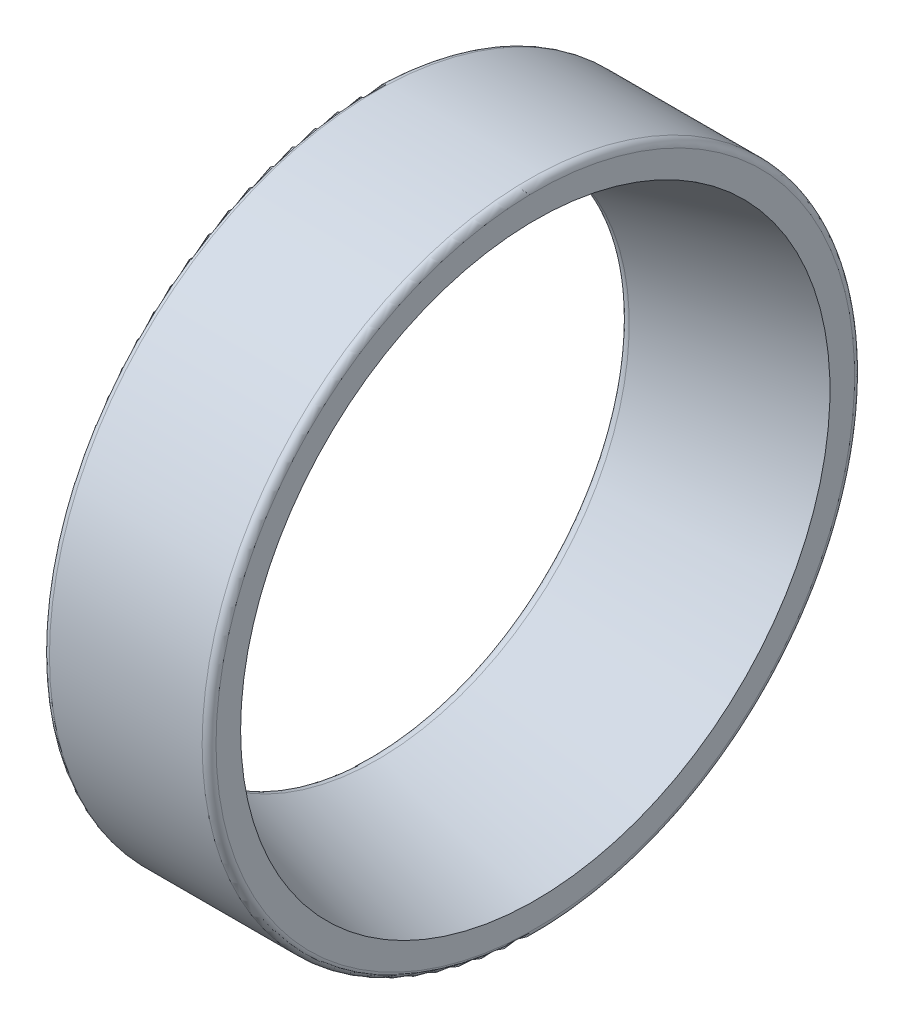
ISO-10303-21;
HEADER;
FILE_DESCRIPTION(('STEP AP214'),'2;1');
FILE_NAME('part.step','',(''),(''),'','','');
FILE_SCHEMA(('AUTOMOTIVE_DESIGN { 1 0 10303 214 1 1 1 1 }'));
ENDSEC;
DATA;
#1=APPLICATION_CONTEXT('core data for automotive mechanical design processes');
#2=APPLICATION_PROTOCOL_DEFINITION('international standard','automotive_design',2000,#1);
#3=PRODUCT_CONTEXT('',#1,'mechanical');
#4=PRODUCT('Part','Part','',(#3));
#5=PRODUCT_RELATED_PRODUCT_CATEGORY('part','',(#4));
#6=PRODUCT_DEFINITION_FORMATION('','',#4);
#7=PRODUCT_DEFINITION_CONTEXT('part definition',#1,'design');
#8=PRODUCT_DEFINITION('design','',#6,#7);
#9=PRODUCT_DEFINITION_SHAPE('','',#8);
#10=(LENGTH_UNIT() NAMED_UNIT(*) SI_UNIT(.MILLI.,.METRE.));
#11=(NAMED_UNIT(*) PLANE_ANGLE_UNIT() SI_UNIT($,.RADIAN.));
#12=(NAMED_UNIT(*) SI_UNIT($,.STERADIAN.) SOLID_ANGLE_UNIT());
#13=UNCERTAINTY_MEASURE_WITH_UNIT(LENGTH_MEASURE(1.E-05),#10,'distance_accuracy_value','');
#14=(GEOMETRIC_REPRESENTATION_CONTEXT(3) GLOBAL_UNCERTAINTY_ASSIGNED_CONTEXT((#13)) GLOBAL_UNIT_ASSIGNED_CONTEXT((#10,
#11,#12)) REPRESENTATION_CONTEXT('',''));
#15=CARTESIAN_POINT('',(0.,0.,0.));
#16=DIRECTION('',(0.,0.,1.));
#17=DIRECTION('',(1.,0.,0.));
#18=AXIS2_PLACEMENT_3D('',#15,#16,#17);
#19=CARTESIAN_POINT('',(0.5,0.,0.));
#20=DIRECTION('',(-1.,0.,0.));
#21=DIRECTION('',(0.,0.,1.));
#22=AXIS2_PLACEMENT_3D('',#19,#20,#21);
#23=TOROIDAL_SURFACE('',#22,18.6203830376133,0.499999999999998);
#24=CARTESIAN_POINT('',(0.63119150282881,0.,0.));
#25=DIRECTION('',(-1.,0.,0.));
#26=DIRECTION('',(0.,0.,1.));
#27=AXIS2_PLACEMENT_3D('',#24,#25,#26);
#28=CIRCLE('',#27,18.1379011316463);
#29=CARTESIAN_POINT('',(0.63119150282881,0.,18.1379011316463));
#30=VERTEX_POINT('',#29);
#31=EDGE_CURVE('E10',#30,#30,#28,.T.);
#32=ORIENTED_EDGE('',*,*,#31,.F.);
#33=EDGE_LOOP('',(#32));
#34=FACE_BOUND('',#33,.T.);
#35=CARTESIAN_POINT('',(0.,0.,0.));
#36=DIRECTION('',(-1.,0.,0.));
#37=DIRECTION('',(0.,0.,1.));
#38=AXIS2_PLACEMENT_3D('',#35,#36,#37);
#39=CIRCLE('',#38,18.6203830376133);
#40=CARTESIAN_POINT('',(0.,0.,18.6203830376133));
#41=VERTEX_POINT('',#40);
#42=EDGE_CURVE('E54',#41,#41,#39,.T.);
#43=ORIENTED_EDGE('',*,*,#42,.T.);
#44=EDGE_LOOP('',(#43));
#45=FACE_BOUND('',#44,.T.);
#46=ADVANCED_FACE('F29',(#34,#45),#23,.T.);
#47=CARTESIAN_POINT('',(10.5722324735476,0.,0.));
#48=DIRECTION('',(1.,0.,0.));
#49=DIRECTION('',(0.,0.,-1.));
#50=AXIS2_PLACEMENT_3D('',#47,#48,#49);
#51=CONICAL_SURFACE('',#50,20.8409664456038,0.265490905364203);
#52=CARTESIAN_POINT('',(12.,0.,0.));
#53=DIRECTION('',(-1.,0.,0.));
#54=DIRECTION('',(0.,0.,1.));
#55=AXIS2_PLACEMENT_3D('',#52,#53,#54);
#56=CIRCLE('',#55,21.2291902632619);
#57=CARTESIAN_POINT('',(12.,0.,21.2291902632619));
#58=VERTEX_POINT('',#57);
#59=EDGE_CURVE('E35',#58,#58,#56,.T.);
#60=ORIENTED_EDGE('',*,*,#59,.F.);
#61=EDGE_LOOP('',(#60));
#62=FACE_BOUND('',#61,.T.);
#63=ORIENTED_EDGE('',*,*,#31,.T.);
#64=EDGE_LOOP('',(#63));
#65=FACE_BOUND('',#64,.T.);
#66=ADVANCED_FACE('F85',(#62,#65),#51,.F.);
#67=CARTESIAN_POINT('',(12.,0.,-23.));
#68=DIRECTION('',(-1.,0.,0.));
#69=DIRECTION('',(0.,0.,1.));
#70=AXIS2_PLACEMENT_3D('',#67,#68,#69);
#71=PLANE('',#70);
#72=CARTESIAN_POINT('',(12.,0.,0.));
#73=DIRECTION('',(-1.,0.,0.));
#74=DIRECTION('',(0.,0.,1.));
#75=AXIS2_PLACEMENT_3D('',#72,#73,#74);
#76=CIRCLE('',#75,23.);
#77=CARTESIAN_POINT('',(12.,0.,23.));
#78=VERTEX_POINT('',#77);
#79=EDGE_CURVE('E39',#78,#78,#76,.T.);
#80=ORIENTED_EDGE('',*,*,#79,.F.);
#81=EDGE_LOOP('',(#80));
#82=FACE_BOUND('',#81,.T.);
#83=ORIENTED_EDGE('',*,*,#59,.T.);
#84=EDGE_LOOP('',(#83));
#85=FACE_BOUND('',#84,.T.);
#86=ADVANCED_FACE('F80',(#82,#85),#71,.F.);
#87=CARTESIAN_POINT('',(11.5,0.,0.));
#88=DIRECTION('',(-1.,0.,0.));
#89=DIRECTION('',(0.,0.,1.));
#90=AXIS2_PLACEMENT_3D('',#87,#88,#89);
#91=TOROIDAL_SURFACE('',#90,23.,0.500000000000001);
#92=CARTESIAN_POINT('',(11.5,0.,0.));
#93=DIRECTION('',(-1.,0.,0.));
#94=DIRECTION('',(0.,0.,1.));
#95=AXIS2_PLACEMENT_3D('',#92,#93,#94);
#96=CIRCLE('',#95,23.5);
#97=CARTESIAN_POINT('',(11.5,0.,23.5));
#98=VERTEX_POINT('',#97);
#99=EDGE_CURVE('E43',#98,#98,#96,.T.);
#100=ORIENTED_EDGE('',*,*,#99,.F.);
#101=EDGE_LOOP('',(#100));
#102=FACE_BOUND('',#101,.T.);
#103=ORIENTED_EDGE('',*,*,#79,.T.);
#104=EDGE_LOOP('',(#103));
#105=FACE_BOUND('',#104,.T.);
#106=ADVANCED_FACE('F74',(#102,#105),#91,.T.);
#107=CARTESIAN_POINT('',(0.,0.,0.));
#108=DIRECTION('',(-1.,0.,0.));
#109=DIRECTION('',(0.,0.,1.));
#110=AXIS2_PLACEMENT_3D('',#107,#108,#109);
#111=CYLINDRICAL_SURFACE('',#110,23.5);
#112=CARTESIAN_POINT('',(0.5,0.,0.));
#113=DIRECTION('',(-1.,0.,0.));
#114=DIRECTION('',(0.,0.,1.));
#115=AXIS2_PLACEMENT_3D('',#112,#113,#114);
#116=CIRCLE('',#115,23.5);
#117=CARTESIAN_POINT('',(0.5,0.,23.5));
#118=VERTEX_POINT('',#117);
#119=EDGE_CURVE('E48',#118,#118,#116,.T.);
#120=ORIENTED_EDGE('',*,*,#119,.F.);
#121=EDGE_LOOP('',(#120));
#122=FACE_BOUND('',#121,.T.);
#123=ORIENTED_EDGE('',*,*,#99,.T.);
#124=EDGE_LOOP('',(#123));
#125=FACE_BOUND('',#124,.T.);
#126=ADVANCED_FACE('F68',(#122,#125),#111,.T.);
#127=CARTESIAN_POINT('',(0.5,0.,0.));
#128=DIRECTION('',(-1.,0.,0.));
#129=DIRECTION('',(0.,0.,1.));
#130=AXIS2_PLACEMENT_3D('',#127,#128,#129);
#131=TOROIDAL_SURFACE('',#130,23.,0.5);
#132=CARTESIAN_POINT('',(0.,0.,0.));
#133=DIRECTION('',(-1.,0.,0.));
#134=DIRECTION('',(0.,0.,1.));
#135=AXIS2_PLACEMENT_3D('',#132,#133,#134);
#136=CIRCLE('',#135,23.);
#137=CARTESIAN_POINT('',(0.,0.,23.));
#138=VERTEX_POINT('',#137);
#139=EDGE_CURVE('E51',#138,#138,#136,.T.);
#140=ORIENTED_EDGE('',*,*,#139,.F.);
#141=EDGE_LOOP('',(#140));
#142=FACE_BOUND('',#141,.T.);
#143=ORIENTED_EDGE('',*,*,#119,.T.);
#144=EDGE_LOOP('',(#143));
#145=FACE_BOUND('',#144,.T.);
#146=ADVANCED_FACE('F62',(#142,#145),#131,.T.);
#147=CARTESIAN_POINT('',(0.,0.,-18.6203830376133));
#148=DIRECTION('',(1.,0.,0.));
#149=DIRECTION('',(0.,0.,-1.));
#150=AXIS2_PLACEMENT_3D('',#147,#148,#149);
#151=PLANE('',#150);
#152=ORIENTED_EDGE('',*,*,#42,.F.);
#153=EDGE_LOOP('',(#152));
#154=FACE_BOUND('',#153,.T.);
#155=ORIENTED_EDGE('',*,*,#139,.T.);
#156=EDGE_LOOP('',(#155));
#157=FACE_BOUND('',#156,.T.);
#158=ADVANCED_FACE('F59',(#154,#157),#151,.F.);
#159=CLOSED_SHELL('',(#46,#66,#86,#106,#126,#146,#158));
#160=MANIFOLD_SOLID_BREP('B2',#159);
#161=ADVANCED_BREP_SHAPE_REPRESENTATION('',(#18,#160),#14);
#162=SHAPE_DEFINITION_REPRESENTATION(#9,#161);
ENDSEC;
END-ISO-10303-21;
